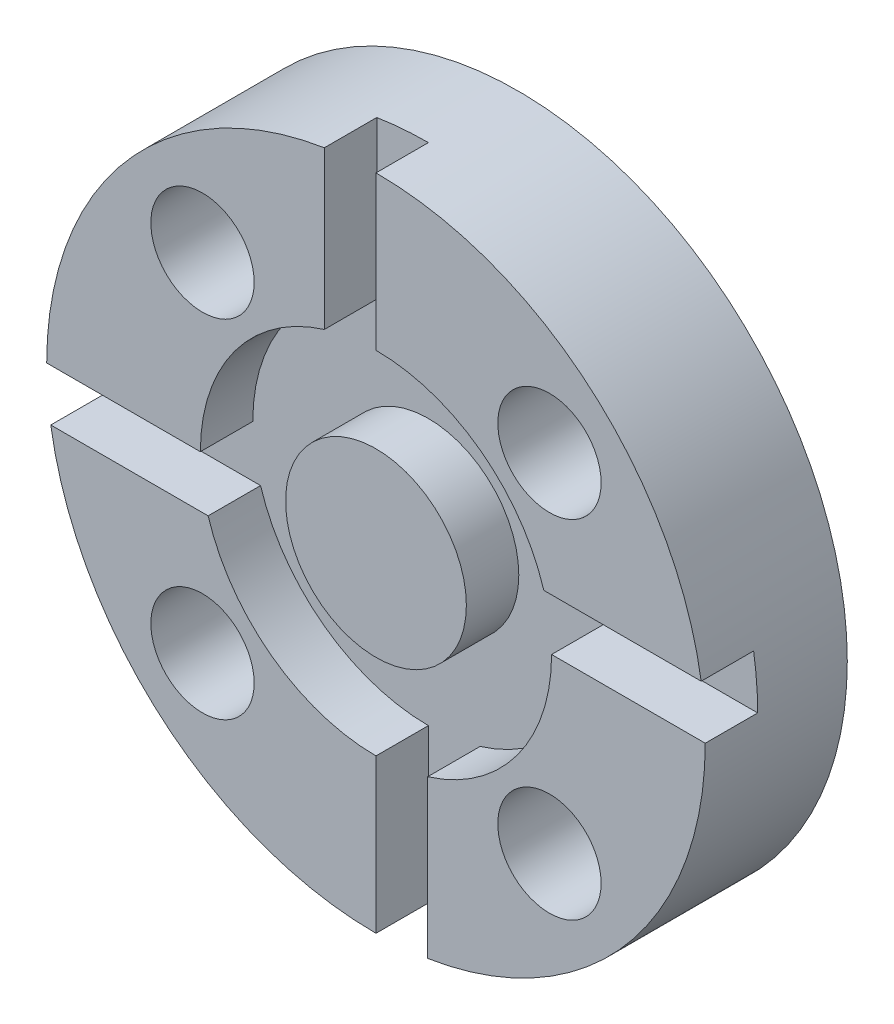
ISO-10303-21;
HEADER;
FILE_DESCRIPTION(('STEP AP214'),'2;1');
FILE_NAME('part.step','',(''),(''),'','','');
FILE_SCHEMA(('AUTOMOTIVE_DESIGN { 1 0 10303 214 1 1 1 1 }'));
ENDSEC;
DATA;
#1=APPLICATION_CONTEXT('core data for automotive mechanical design processes');
#2=APPLICATION_PROTOCOL_DEFINITION('international standard','automotive_design',2000,#1);
#3=PRODUCT_CONTEXT('',#1,'mechanical');
#4=PRODUCT('Part','Part','',(#3));
#5=PRODUCT_RELATED_PRODUCT_CATEGORY('part','',(#4));
#6=PRODUCT_DEFINITION_FORMATION('','',#4);
#7=PRODUCT_DEFINITION_CONTEXT('part definition',#1,'design');
#8=PRODUCT_DEFINITION('design','',#6,#7);
#9=PRODUCT_DEFINITION_SHAPE('','',#8);
#10=(LENGTH_UNIT() NAMED_UNIT(*) SI_UNIT(.MILLI.,.METRE.));
#11=(NAMED_UNIT(*) PLANE_ANGLE_UNIT() SI_UNIT($,.RADIAN.));
#12=(NAMED_UNIT(*) SI_UNIT($,.STERADIAN.) SOLID_ANGLE_UNIT());
#13=UNCERTAINTY_MEASURE_WITH_UNIT(LENGTH_MEASURE(1.E-05),#10,'distance_accuracy_value','');
#14=(GEOMETRIC_REPRESENTATION_CONTEXT(3) GLOBAL_UNCERTAINTY_ASSIGNED_CONTEXT((#13)) GLOBAL_UNIT_ASSIGNED_CONTEXT((#10,
#11,#12)) REPRESENTATION_CONTEXT('',''));
#15=CARTESIAN_POINT('',(0.,0.,0.));
#16=DIRECTION('',(0.,0.,1.));
#17=DIRECTION('',(1.,0.,0.));
#18=AXIS2_PLACEMENT_3D('',#15,#16,#17);
#19=CARTESIAN_POINT('',(0.,0.,55.));
#20=DIRECTION('',(0.,0.,1.));
#21=DIRECTION('',(1.,0.,0.));
#22=AXIS2_PLACEMENT_3D('',#19,#20,#21);
#23=PLANE('',#22);
#24=DIRECTION('',(0.,-1.,0.));
#25=VECTOR('',#24,1.);
#26=CARTESIAN_POINT('',(-20.,28.7228132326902,55.));
#27=LINE('',#26,#25);
#28=CARTESIAN_POINT('',(-20.,125.92160259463,55.));
#29=VERTEX_POINT('',#28);
#30=CARTESIAN_POINT('',(-20.,64.9923072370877,55.));
#31=VERTEX_POINT('',#30);
#32=EDGE_CURVE('E159',#29,#31,#27,.T.);
#33=ORIENTED_EDGE('',*,*,#32,.F.);
#34=CARTESIAN_POINT('',(0.,0.,55.));
#35=DIRECTION('',(0.,0.,1.));
#36=DIRECTION('',(1.,0.,0.));
#37=AXIS2_PLACEMENT_3D('',#34,#35,#36);
#38=CIRCLE('',#37,127.5);
#39=CARTESIAN_POINT('',(-127.5,0.,55.));
#40=VERTEX_POINT('',#39);
#41=EDGE_CURVE('E52',#29,#40,#38,.T.);
#42=ORIENTED_EDGE('',*,*,#41,.T.);
#43=DIRECTION('',(-1.,0.,0.));
#44=VECTOR('',#43,1.);
#45=CARTESIAN_POINT('',(-35.,0.,55.));
#46=LINE('',#45,#44);
#47=CARTESIAN_POINT('',(-68.,0.,55.));
#48=VERTEX_POINT('',#47);
#49=EDGE_CURVE('E242',#48,#40,#46,.T.);
#50=ORIENTED_EDGE('',*,*,#49,.F.);
#51=CARTESIAN_POINT('',(0.,0.,55.));
#52=DIRECTION('',(0.,0.,1.));
#53=DIRECTION('',(1.,0.,0.));
#54=AXIS2_PLACEMENT_3D('',#51,#52,#53);
#55=CIRCLE('',#54,68.);
#56=EDGE_CURVE('E173',#31,#48,#55,.T.);
#57=ORIENTED_EDGE('',*,*,#56,.F.);
#58=EDGE_LOOP('',(#33,#42,#50,#57));
#59=FACE_BOUND('',#58,.T.);
#60=CARTESIAN_POINT('',(-67.1751442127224,67.1751442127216,55.));
#61=DIRECTION('',(0.,0.,1.));
#62=DIRECTION('',(1.,0.,0.));
#63=AXIS2_PLACEMENT_3D('',#60,#61,#62);
#64=CIRCLE('',#63,20.);
#65=CARTESIAN_POINT('',(-47.1751442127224,67.1751442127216,55.));
#66=VERTEX_POINT('',#65);
#67=EDGE_CURVE('E184',#66,#66,#64,.T.);
#68=ORIENTED_EDGE('',*,*,#67,.F.);
#69=EDGE_LOOP('',(#68));
#70=FACE_BOUND('',#69,.T.);
#71=ADVANCED_FACE('F43',(#59,#70),#23,.T.);
#72=CARTESIAN_POINT('',(0.,0.,34.7));
#73=DIRECTION('',(0.,0.,1.));
#74=DIRECTION('',(1.,0.,0.));
#75=AXIS2_PLACEMENT_3D('',#72,#73,#74);
#76=CYLINDRICAL_SURFACE('',#75,68.);
#77=CARTESIAN_POINT('',(0.,0.,34.7));
#78=DIRECTION('',(0.,0.,1.));
#79=DIRECTION('',(1.,0.,0.));
#80=AXIS2_PLACEMENT_3D('',#77,#78,#79);
#81=CIRCLE('',#80,68.);
#82=CARTESIAN_POINT('',(-20.,64.9923072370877,34.7));
#83=VERTEX_POINT('',#82);
#84=CARTESIAN_POINT('',(-68.,0.,34.7));
#85=VERTEX_POINT('',#84);
#86=EDGE_CURVE('E214',#83,#85,#81,.T.);
#87=ORIENTED_EDGE('',*,*,#86,.F.);
#88=DIRECTION('',(0.,0.,1.));
#89=VECTOR('',#88,1.);
#90=CARTESIAN_POINT('',(-20.,64.9923072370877,34.7));
#91=LINE('',#90,#89);
#92=EDGE_CURVE('E166',#83,#31,#91,.T.);
#93=ORIENTED_EDGE('',*,*,#92,.T.);
#94=ORIENTED_EDGE('',*,*,#56,.T.);
#95=DIRECTION('',(0.,0.,1.));
#96=VECTOR('',#95,1.);
#97=CARTESIAN_POINT('',(-68.,0.,34.7));
#98=LINE('',#97,#96);
#99=EDGE_CURVE('E226',#48,#85,#98,.F.);
#100=ORIENTED_EDGE('',*,*,#99,.T.);
#101=EDGE_LOOP('',(#87,#93,#94,#100));
#102=FACE_BOUND('',#101,.T.);
#103=ADVANCED_FACE('F327',(#102),#76,.F.);
#104=DIRECTION('',(1.,0.,0.));
#105=VECTOR('',#104,1.);
#106=CARTESIAN_POINT('',(35.,0.,55.));
#107=LINE('',#106,#105);
#108=CARTESIAN_POINT('',(68.,0.,55.));
#109=VERTEX_POINT('',#108);
#110=CARTESIAN_POINT('',(127.5,0.,55.));
#111=VERTEX_POINT('',#110);
#112=EDGE_CURVE('E287',#109,#111,#107,.T.);
#113=ORIENTED_EDGE('',*,*,#112,.F.);
#114=CARTESIAN_POINT('',(20.,-64.9923072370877,55.));
#115=VERTEX_POINT('',#114);
#116=EDGE_CURVE('E218',#115,#109,#55,.T.);
#117=ORIENTED_EDGE('',*,*,#116,.F.);
#118=DIRECTION('',(0.,1.,0.));
#119=VECTOR('',#118,1.);
#120=CARTESIAN_POINT('',(20.,-28.7228132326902,55.));
#121=LINE('',#120,#119);
#122=CARTESIAN_POINT('',(20.,-125.92160259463,55.));
#123=VERTEX_POINT('',#122);
#124=EDGE_CURVE('E267',#123,#115,#121,.T.);
#125=ORIENTED_EDGE('',*,*,#124,.F.);
#126=EDGE_CURVE('E51',#123,#111,#38,.T.);
#127=ORIENTED_EDGE('',*,*,#126,.T.);
#128=EDGE_LOOP('',(#113,#117,#125,#127));
#129=FACE_BOUND('',#128,.T.);
#130=CARTESIAN_POINT('',(67.1751442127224,-67.1751442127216,55.));
#131=DIRECTION('',(0.,0.,1.));
#132=DIRECTION('',(1.,0.,0.));
#133=AXIS2_PLACEMENT_3D('',#130,#131,#132);
#134=CIRCLE('',#133,20.000000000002);
#135=CARTESIAN_POINT('',(87.1751442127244,-67.1751442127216,55.));
#136=VERTEX_POINT('',#135);
#137=EDGE_CURVE('E198',#136,#136,#134,.T.);
#138=ORIENTED_EDGE('',*,*,#137,.F.);
#139=EDGE_LOOP('',(#138));
#140=FACE_BOUND('',#139,.T.);
#141=ADVANCED_FACE('F337',(#129,#140),#23,.T.);
#142=ORIENTED_EDGE('',*,*,#116,.T.);
#143=DIRECTION('',(0.,0.,1.));
#144=VECTOR('',#143,1.);
#145=CARTESIAN_POINT('',(68.,0.,34.7));
#146=LINE('',#145,#144);
#147=CARTESIAN_POINT('',(68.,0.,34.7));
#148=VERTEX_POINT('',#147);
#149=EDGE_CURVE('E269',#109,#148,#146,.F.);
#150=ORIENTED_EDGE('',*,*,#149,.T.);
#151=CARTESIAN_POINT('',(20.,-64.9923072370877,34.7));
#152=VERTEX_POINT('',#151);
#153=EDGE_CURVE('E213',#152,#148,#81,.T.);
#154=ORIENTED_EDGE('',*,*,#153,.F.);
#155=DIRECTION('',(0.,0.,1.));
#156=VECTOR('',#155,1.);
#157=CARTESIAN_POINT('',(20.,-64.9923072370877,34.7));
#158=LINE('',#157,#156);
#159=EDGE_CURVE('E257',#152,#115,#158,.T.);
#160=ORIENTED_EDGE('',*,*,#159,.T.);
#161=EDGE_LOOP('',(#142,#150,#154,#160));
#162=FACE_BOUND('',#161,.T.);
#163=ADVANCED_FACE('F331',(#162),#76,.F.);
#164=DIRECTION('',(0.,1.,0.));
#165=VECTOR('',#164,1.);
#166=CARTESIAN_POINT('',(0.,35.,55.));
#167=LINE('',#166,#165);
#168=CARTESIAN_POINT('',(0.,68.,55.));
#169=VERTEX_POINT('',#168);
#170=CARTESIAN_POINT('',(0.,127.5,55.));
#171=VERTEX_POINT('',#170);
#172=EDGE_CURVE('E174',#169,#171,#167,.T.);
#173=ORIENTED_EDGE('',*,*,#172,.F.);
#174=CARTESIAN_POINT('',(64.9923072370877,20.,55.));
#175=VERTEX_POINT('',#174);
#176=EDGE_CURVE('E312',#175,#169,#55,.T.);
#177=ORIENTED_EDGE('',*,*,#176,.F.);
#178=DIRECTION('',(-1.,0.,0.));
#179=VECTOR('',#178,1.);
#180=CARTESIAN_POINT('',(28.7228132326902,20.,55.));
#181=LINE('',#180,#179);
#182=CARTESIAN_POINT('',(125.92160259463,20.,55.));
#183=VERTEX_POINT('',#182);
#184=EDGE_CURVE('E289',#183,#175,#181,.T.);
#185=ORIENTED_EDGE('',*,*,#184,.F.);
#186=EDGE_CURVE('E180',#183,#171,#38,.T.);
#187=ORIENTED_EDGE('',*,*,#186,.T.);
#188=EDGE_LOOP('',(#173,#177,#185,#187));
#189=FACE_BOUND('',#188,.T.);
#190=CARTESIAN_POINT('',(67.1751442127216,67.1751442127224,55.));
#191=DIRECTION('',(0.,0.,1.));
#192=DIRECTION('',(1.,0.,0.));
#193=AXIS2_PLACEMENT_3D('',#190,#191,#192);
#194=CIRCLE('',#193,20.0000000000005);
#195=CARTESIAN_POINT('',(87.1751442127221,67.1751442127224,55.));
#196=VERTEX_POINT('',#195);
#197=EDGE_CURVE('E192',#196,#196,#194,.T.);
#198=ORIENTED_EDGE('',*,*,#197,.F.);
#199=EDGE_LOOP('',(#198));
#200=FACE_BOUND('',#199,.T.);
#201=ADVANCED_FACE('F310',(#189,#200),#23,.T.);
#202=ORIENTED_EDGE('',*,*,#176,.T.);
#203=DIRECTION('',(0.,0.,1.));
#204=VECTOR('',#203,1.);
#205=CARTESIAN_POINT('',(0.,68.,34.7));
#206=LINE('',#205,#204);
#207=CARTESIAN_POINT('',(0.,68.,34.7));
#208=VERTEX_POINT('',#207);
#209=EDGE_CURVE('E291',#169,#208,#206,.F.);
#210=ORIENTED_EDGE('',*,*,#209,.T.);
#211=CARTESIAN_POINT('',(64.9923072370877,20.,34.7));
#212=VERTEX_POINT('',#211);
#213=EDGE_CURVE('E319',#212,#208,#81,.T.);
#214=ORIENTED_EDGE('',*,*,#213,.F.);
#215=DIRECTION('',(0.,0.,1.));
#216=VECTOR('',#215,1.);
#217=CARTESIAN_POINT('',(64.9923072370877,20.,34.7));
#218=LINE('',#217,#216);
#219=EDGE_CURVE('E277',#212,#175,#218,.T.);
#220=ORIENTED_EDGE('',*,*,#219,.T.);
#221=EDGE_LOOP('',(#202,#210,#214,#220));
#222=FACE_BOUND('',#221,.T.);
#223=ADVANCED_FACE('F318',(#222),#76,.F.);
#224=DIRECTION('',(0.,-1.,0.));
#225=VECTOR('',#224,1.);
#226=CARTESIAN_POINT('',(0.,-35.,55.));
#227=LINE('',#226,#225);
#228=CARTESIAN_POINT('',(0.,-68.,55.));
#229=VERTEX_POINT('',#228);
#230=CARTESIAN_POINT('',(0.,-127.5,55.));
#231=VERTEX_POINT('',#230);
#232=EDGE_CURVE('E265',#229,#231,#227,.T.);
#233=ORIENTED_EDGE('',*,*,#232,.F.);
#234=CARTESIAN_POINT('',(-64.9923072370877,-20.,55.));
#235=VERTEX_POINT('',#234);
#236=EDGE_CURVE('E215',#235,#229,#55,.T.);
#237=ORIENTED_EDGE('',*,*,#236,.F.);
#238=DIRECTION('',(1.,0.,0.));
#239=VECTOR('',#238,1.);
#240=CARTESIAN_POINT('',(-140.,-20.,55.));
#241=LINE('',#240,#239);
#242=CARTESIAN_POINT('',(-125.92160259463,-20.,55.));
#243=VERTEX_POINT('',#242);
#244=EDGE_CURVE('E244',#243,#235,#241,.T.);
#245=ORIENTED_EDGE('',*,*,#244,.F.);
#246=EDGE_CURVE('E13',#243,#231,#38,.T.);
#247=ORIENTED_EDGE('',*,*,#246,.T.);
#248=EDGE_LOOP('',(#233,#237,#245,#247));
#249=FACE_BOUND('',#248,.T.);
#250=CARTESIAN_POINT('',(-67.17514421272,-67.1751442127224,55.));
#251=DIRECTION('',(0.,0.,1.));
#252=DIRECTION('',(1.,0.,0.));
#253=AXIS2_PLACEMENT_3D('',#250,#251,#252);
#254=CIRCLE('',#253,20.);
#255=CARTESIAN_POINT('',(-47.17514421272,-67.1751442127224,55.));
#256=VERTEX_POINT('',#255);
#257=EDGE_CURVE('E204',#256,#256,#254,.T.);
#258=ORIENTED_EDGE('',*,*,#257,.F.);
#259=EDGE_LOOP('',(#258));
#260=FACE_BOUND('',#259,.T.);
#261=ADVANCED_FACE('F358',(#249,#260),#23,.T.);
#262=CARTESIAN_POINT('',(0.,0.,0.));
#263=DIRECTION('',(0.,0.,1.));
#264=DIRECTION('',(1.,0.,0.));
#265=AXIS2_PLACEMENT_3D('',#262,#263,#264);
#266=PLANE('',#265);
#267=CARTESIAN_POINT('',(67.1751442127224,-67.1751442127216,0.));
#268=DIRECTION('',(0.,0.,1.));
#269=DIRECTION('',(1.,0.,0.));
#270=AXIS2_PLACEMENT_3D('',#267,#268,#269);
#271=CIRCLE('',#270,20.000000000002);
#272=CARTESIAN_POINT('',(87.1751442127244,-67.1751442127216,0.));
#273=VERTEX_POINT('',#272);
#274=EDGE_CURVE('E201',#273,#273,#271,.T.);
#275=ORIENTED_EDGE('',*,*,#274,.T.);
#276=EDGE_LOOP('',(#275));
#277=FACE_BOUND('',#276,.T.);
#278=CARTESIAN_POINT('',(-67.1751442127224,67.1751442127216,0.));
#279=DIRECTION('',(0.,0.,1.));
#280=DIRECTION('',(1.,0.,0.));
#281=AXIS2_PLACEMENT_3D('',#278,#279,#280);
#282=CIRCLE('',#281,20.);
#283=CARTESIAN_POINT('',(-47.1751442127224,67.1751442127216,0.));
#284=VERTEX_POINT('',#283);
#285=EDGE_CURVE('E187',#284,#284,#282,.T.);
#286=ORIENTED_EDGE('',*,*,#285,.T.);
#287=EDGE_LOOP('',(#286));
#288=FACE_BOUND('',#287,.T.);
#289=CARTESIAN_POINT('',(0.,0.,0.));
#290=DIRECTION('',(0.,0.,1.));
#291=DIRECTION('',(1.,0.,0.));
#292=AXIS2_PLACEMENT_3D('',#289,#290,#291);
#293=CIRCLE('',#292,127.5);
#294=CARTESIAN_POINT('',(127.5,0.,0.));
#295=VERTEX_POINT('',#294);
#296=EDGE_CURVE('E181',#295,#295,#293,.T.);
#297=ORIENTED_EDGE('',*,*,#296,.F.);
#298=EDGE_LOOP('',(#297));
#299=FACE_BOUND('',#298,.T.);
#300=CARTESIAN_POINT('',(67.1751442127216,67.1751442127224,0.));
#301=DIRECTION('',(0.,0.,1.));
#302=DIRECTION('',(1.,0.,0.));
#303=AXIS2_PLACEMENT_3D('',#300,#301,#302);
#304=CIRCLE('',#303,20.0000000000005);
#305=CARTESIAN_POINT('',(87.1751442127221,67.1751442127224,0.));
#306=VERTEX_POINT('',#305);
#307=EDGE_CURVE('E195',#306,#306,#304,.T.);
#308=ORIENTED_EDGE('',*,*,#307,.T.);
#309=EDGE_LOOP('',(#308));
#310=FACE_BOUND('',#309,.T.);
#311=CARTESIAN_POINT('',(-67.17514421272,-67.1751442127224,0.));
#312=DIRECTION('',(0.,0.,1.));
#313=DIRECTION('',(1.,0.,0.));
#314=AXIS2_PLACEMENT_3D('',#311,#312,#313);
#315=CIRCLE('',#314,20.);
#316=CARTESIAN_POINT('',(-47.17514421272,-67.1751442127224,0.));
#317=VERTEX_POINT('',#316);
#318=EDGE_CURVE('E207',#317,#317,#315,.T.);
#319=ORIENTED_EDGE('',*,*,#318,.T.);
#320=EDGE_LOOP('',(#319));
#321=FACE_BOUND('',#320,.T.);
#322=ADVANCED_FACE('F382',(#277,#288,#299,#310,#321),#266,.F.);
#323=CARTESIAN_POINT('',(0.,0.,55.));
#324=DIRECTION('',(0.,0.,-1.));
#325=DIRECTION('',(-1.,0.,0.));
#326=AXIS2_PLACEMENT_3D('',#323,#324,#325);
#327=CYLINDRICAL_SURFACE('',#326,127.5);
#328=ORIENTED_EDGE('',*,*,#41,.F.);
#329=DIRECTION('',(0.,0.,-1.));
#330=VECTOR('',#329,1.);
#331=CARTESIAN_POINT('',(-20.,125.92160259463,55.));
#332=LINE('',#331,#330);
#333=CARTESIAN_POINT('',(-20.,125.92160259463,34.7));
#334=VERTEX_POINT('',#333);
#335=EDGE_CURVE('E156',#29,#334,#332,.T.);
#336=ORIENTED_EDGE('',*,*,#335,.T.);
#337=CARTESIAN_POINT('',(0.,0.,34.7));
#338=DIRECTION('',(0.,0.,1.));
#339=DIRECTION('',(1.,0.,0.));
#340=AXIS2_PLACEMENT_3D('',#337,#338,#339);
#341=CIRCLE('',#340,127.5);
#342=CARTESIAN_POINT('',(0.,127.5,34.7));
#343=VERTEX_POINT('',#342);
#344=EDGE_CURVE('E297',#343,#334,#341,.T.);
#345=ORIENTED_EDGE('',*,*,#344,.F.);
#346=DIRECTION('',(0.,0.,-1.));
#347=VECTOR('',#346,1.);
#348=CARTESIAN_POINT('',(0.,127.5,55.));
#349=LINE('',#348,#347);
#350=EDGE_CURVE('E294',#343,#171,#349,.F.);
#351=ORIENTED_EDGE('',*,*,#350,.T.);
#352=ORIENTED_EDGE('',*,*,#186,.F.);
#353=DIRECTION('',(0.,0.,-1.));
#354=VECTOR('',#353,1.);
#355=CARTESIAN_POINT('',(125.92160259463,20.,55.));
#356=LINE('',#355,#354);
#357=CARTESIAN_POINT('',(125.92160259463,20.,34.7));
#358=VERTEX_POINT('',#357);
#359=EDGE_CURVE('E280',#183,#358,#356,.T.);
#360=ORIENTED_EDGE('',*,*,#359,.T.);
#361=CARTESIAN_POINT('',(0.,0.,34.7));
#362=DIRECTION('',(0.,0.,1.));
#363=DIRECTION('',(1.,0.,0.));
#364=AXIS2_PLACEMENT_3D('',#361,#362,#363);
#365=CIRCLE('',#364,127.5);
#366=CARTESIAN_POINT('',(127.5,0.,34.7));
#367=VERTEX_POINT('',#366);
#368=EDGE_CURVE('E275',#367,#358,#365,.T.);
#369=ORIENTED_EDGE('',*,*,#368,.F.);
#370=DIRECTION('',(0.,0.,-1.));
#371=VECTOR('',#370,1.);
#372=CARTESIAN_POINT('',(127.5,0.,55.));
#373=LINE('',#372,#371);
#374=EDGE_CURVE('E272',#367,#111,#373,.F.);
#375=ORIENTED_EDGE('',*,*,#374,.T.);
#376=ORIENTED_EDGE('',*,*,#126,.F.);
#377=DIRECTION('',(0.,0.,-1.));
#378=VECTOR('',#377,1.);
#379=CARTESIAN_POINT('',(20.,-125.92160259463,55.));
#380=LINE('',#379,#378);
#381=CARTESIAN_POINT('',(20.,-125.92160259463,34.7));
#382=VERTEX_POINT('',#381);
#383=EDGE_CURVE('E254',#123,#382,#380,.T.);
#384=ORIENTED_EDGE('',*,*,#383,.T.);
#385=CARTESIAN_POINT('',(0.,0.,34.7));
#386=DIRECTION('',(0.,0.,1.));
#387=DIRECTION('',(1.,0.,0.));
#388=AXIS2_PLACEMENT_3D('',#385,#386,#387);
#389=CIRCLE('',#388,127.5);
#390=CARTESIAN_POINT('',(0.,-127.5,34.7));
#391=VERTEX_POINT('',#390);
#392=EDGE_CURVE('E252',#391,#382,#389,.T.);
#393=ORIENTED_EDGE('',*,*,#392,.F.);
#394=DIRECTION('',(0.,0.,-1.));
#395=VECTOR('',#394,1.);
#396=CARTESIAN_POINT('',(0.,-127.5,55.));
#397=LINE('',#396,#395);
#398=EDGE_CURVE('E246',#391,#231,#397,.F.);
#399=ORIENTED_EDGE('',*,*,#398,.T.);
#400=ORIENTED_EDGE('',*,*,#246,.F.);
#401=DIRECTION('',(0.,0.,-1.));
#402=VECTOR('',#401,1.);
#403=CARTESIAN_POINT('',(-125.92160259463,-20.,55.));
#404=LINE('',#403,#402);
#405=CARTESIAN_POINT('',(-125.92160259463,-20.,34.7));
#406=VERTEX_POINT('',#405);
#407=EDGE_CURVE('E231',#243,#406,#404,.T.);
#408=ORIENTED_EDGE('',*,*,#407,.T.);
#409=CARTESIAN_POINT('',(0.,0.,34.7));
#410=DIRECTION('',(0.,0.,1.));
#411=DIRECTION('',(1.,0.,0.));
#412=AXIS2_PLACEMENT_3D('',#409,#410,#411);
#413=CIRCLE('',#412,127.5);
#414=CARTESIAN_POINT('',(-127.5,0.,34.7));
#415=VERTEX_POINT('',#414);
#416=EDGE_CURVE('E229',#415,#406,#413,.T.);
#417=ORIENTED_EDGE('',*,*,#416,.F.);
#418=DIRECTION('',(0.,0.,-1.));
#419=VECTOR('',#418,1.);
#420=CARTESIAN_POINT('',(-127.5,0.,55.));
#421=LINE('',#420,#419);
#422=EDGE_CURVE('E179',#415,#40,#421,.F.);
#423=ORIENTED_EDGE('',*,*,#422,.T.);
#424=EDGE_LOOP('',(#328,#336,#345,#351,#352,#360,#369,#375,#376,#384,#393,#399,#400,#408,#417,#423));
#425=FACE_BOUND('',#424,.T.);
#426=ORIENTED_EDGE('',*,*,#296,.T.);
#427=EDGE_LOOP('',(#426));
#428=FACE_BOUND('',#427,.T.);
#429=ADVANCED_FACE('F45',(#425,#428),#327,.T.);
#430=CARTESIAN_POINT('',(-67.1751442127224,67.1751442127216,55.));
#431=DIRECTION('',(0.,0.,-1.));
#432=DIRECTION('',(-1.,0.,0.));
#433=AXIS2_PLACEMENT_3D('',#430,#431,#432);
#434=CYLINDRICAL_SURFACE('',#433,20.);
#435=ORIENTED_EDGE('',*,*,#67,.T.);
#436=EDGE_LOOP('',(#435));
#437=FACE_BOUND('',#436,.T.);
#438=ORIENTED_EDGE('',*,*,#285,.F.);
#439=EDGE_LOOP('',(#438));
#440=FACE_BOUND('',#439,.T.);
#441=ADVANCED_FACE('F415',(#437,#440),#434,.F.);
#442=CARTESIAN_POINT('',(67.1751442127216,67.1751442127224,55.));
#443=DIRECTION('',(0.,0.,-1.));
#444=DIRECTION('',(-1.,0.,0.));
#445=AXIS2_PLACEMENT_3D('',#442,#443,#444);
#446=CYLINDRICAL_SURFACE('',#445,20.0000000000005);
#447=ORIENTED_EDGE('',*,*,#197,.T.);
#448=EDGE_LOOP('',(#447));
#449=FACE_BOUND('',#448,.T.);
#450=ORIENTED_EDGE('',*,*,#307,.F.);
#451=EDGE_LOOP('',(#450));
#452=FACE_BOUND('',#451,.T.);
#453=ADVANCED_FACE('F411',(#449,#452),#446,.F.);
#454=CARTESIAN_POINT('',(67.1751442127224,-67.1751442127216,55.));
#455=DIRECTION('',(0.,0.,-1.));
#456=DIRECTION('',(-1.,0.,0.));
#457=AXIS2_PLACEMENT_3D('',#454,#455,#456);
#458=CYLINDRICAL_SURFACE('',#457,20.000000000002);
#459=ORIENTED_EDGE('',*,*,#137,.T.);
#460=EDGE_LOOP('',(#459));
#461=FACE_BOUND('',#460,.T.);
#462=ORIENTED_EDGE('',*,*,#274,.F.);
#463=EDGE_LOOP('',(#462));
#464=FACE_BOUND('',#463,.T.);
#465=ADVANCED_FACE('F407',(#461,#464),#458,.F.);
#466=CARTESIAN_POINT('',(-67.17514421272,-67.1751442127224,55.));
#467=DIRECTION('',(0.,0.,-1.));
#468=DIRECTION('',(-1.,0.,0.));
#469=AXIS2_PLACEMENT_3D('',#466,#467,#468);
#470=CYLINDRICAL_SURFACE('',#469,20.);
#471=ORIENTED_EDGE('',*,*,#257,.T.);
#472=EDGE_LOOP('',(#471));
#473=FACE_BOUND('',#472,.T.);
#474=ORIENTED_EDGE('',*,*,#318,.F.);
#475=EDGE_LOOP('',(#474));
#476=FACE_BOUND('',#475,.T.);
#477=ADVANCED_FACE('F404',(#473,#476),#470,.F.);
#478=ORIENTED_EDGE('',*,*,#236,.T.);
#479=DIRECTION('',(0.,0.,1.));
#480=VECTOR('',#479,1.);
#481=CARTESIAN_POINT('',(0.,-68.,34.7));
#482=LINE('',#481,#480);
#483=CARTESIAN_POINT('',(0.,-68.,34.7));
#484=VERTEX_POINT('',#483);
#485=EDGE_CURVE('E249',#229,#484,#482,.F.);
#486=ORIENTED_EDGE('',*,*,#485,.T.);
#487=CARTESIAN_POINT('',(-64.9923072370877,-20.,34.7));
#488=VERTEX_POINT('',#487);
#489=EDGE_CURVE('E210',#488,#484,#81,.T.);
#490=ORIENTED_EDGE('',*,*,#489,.F.);
#491=DIRECTION('',(0.,0.,1.));
#492=VECTOR('',#491,1.);
#493=CARTESIAN_POINT('',(-64.9923072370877,-20.,34.7));
#494=LINE('',#493,#492);
#495=EDGE_CURVE('E234',#488,#235,#494,.T.);
#496=ORIENTED_EDGE('',*,*,#495,.T.);
#497=EDGE_LOOP('',(#478,#486,#490,#496));
#498=FACE_BOUND('',#497,.T.);
#499=ADVANCED_FACE('F353',(#498),#76,.F.);
#500=CARTESIAN_POINT('',(0.,0.,34.7));
#501=DIRECTION('',(0.,0.,1.));
#502=DIRECTION('',(1.,0.,0.));
#503=AXIS2_PLACEMENT_3D('',#500,#501,#502);
#504=PLANE('',#503);
#505=CARTESIAN_POINT('',(0.,0.,34.7));
#506=DIRECTION('',(0.,0.,1.));
#507=DIRECTION('',(1.,0.,0.));
#508=AXIS2_PLACEMENT_3D('',#505,#506,#507);
#509=CIRCLE('',#508,35.);
#510=CARTESIAN_POINT('',(35.,0.,34.7));
#511=VERTEX_POINT('',#510);
#512=EDGE_CURVE('E219',#511,#511,#509,.T.);
#513=ORIENTED_EDGE('',*,*,#512,.F.);
#514=EDGE_LOOP('',(#513));
#515=FACE_BOUND('',#514,.T.);
#516=ORIENTED_EDGE('',*,*,#213,.T.);
#517=DIRECTION('',(0.,1.,0.));
#518=VECTOR('',#517,1.);
#519=CARTESIAN_POINT('',(0.,35.,34.7));
#520=LINE('',#519,#518);
#521=EDGE_CURVE('E59',#208,#343,#520,.T.);
#522=ORIENTED_EDGE('',*,*,#521,.T.);
#523=ORIENTED_EDGE('',*,*,#344,.T.);
#524=DIRECTION('',(0.,-1.,0.));
#525=VECTOR('',#524,1.);
#526=CARTESIAN_POINT('',(-20.,28.7228132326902,34.7));
#527=LINE('',#526,#525);
#528=EDGE_CURVE('E162',#334,#83,#527,.T.);
#529=ORIENTED_EDGE('',*,*,#528,.T.);
#530=ORIENTED_EDGE('',*,*,#86,.T.);
#531=DIRECTION('',(-1.,0.,0.));
#532=VECTOR('',#531,1.);
#533=CARTESIAN_POINT('',(-35.,0.,34.7));
#534=LINE('',#533,#532);
#535=EDGE_CURVE('E237',#85,#415,#534,.T.);
#536=ORIENTED_EDGE('',*,*,#535,.T.);
#537=ORIENTED_EDGE('',*,*,#416,.T.);
#538=DIRECTION('',(1.,0.,0.));
#539=VECTOR('',#538,1.);
#540=CARTESIAN_POINT('',(-140.,-20.,34.7));
#541=LINE('',#540,#539);
#542=EDGE_CURVE('E240',#406,#488,#541,.T.);
#543=ORIENTED_EDGE('',*,*,#542,.T.);
#544=ORIENTED_EDGE('',*,*,#489,.T.);
#545=DIRECTION('',(0.,-1.,0.));
#546=VECTOR('',#545,1.);
#547=CARTESIAN_POINT('',(0.,-35.,34.7));
#548=LINE('',#547,#546);
#549=EDGE_CURVE('E260',#484,#391,#548,.T.);
#550=ORIENTED_EDGE('',*,*,#549,.T.);
#551=ORIENTED_EDGE('',*,*,#392,.T.);
#552=DIRECTION('',(0.,1.,0.));
#553=VECTOR('',#552,1.);
#554=CARTESIAN_POINT('',(20.,-28.7228132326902,34.7));
#555=LINE('',#554,#553);
#556=EDGE_CURVE('E263',#382,#152,#555,.T.);
#557=ORIENTED_EDGE('',*,*,#556,.T.);
#558=ORIENTED_EDGE('',*,*,#153,.T.);
#559=DIRECTION('',(1.,0.,0.));
#560=VECTOR('',#559,1.);
#561=CARTESIAN_POINT('',(35.,0.,34.7));
#562=LINE('',#561,#560);
#563=EDGE_CURVE('E66',#148,#367,#562,.T.);
#564=ORIENTED_EDGE('',*,*,#563,.T.);
#565=ORIENTED_EDGE('',*,*,#368,.T.);
#566=DIRECTION('',(-1.,0.,0.));
#567=VECTOR('',#566,1.);
#568=CARTESIAN_POINT('',(28.7228132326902,20.,34.7));
#569=LINE('',#568,#567);
#570=EDGE_CURVE('E284',#358,#212,#569,.T.);
#571=ORIENTED_EDGE('',*,*,#570,.T.);
#572=EDGE_LOOP('',(#516,#522,#523,#529,#530,#536,#537,#543,#544,#550,#551,#557,#558,#564,#565,#571));
#573=FACE_BOUND('',#572,.T.);
#574=ADVANCED_FACE('F322',(#515,#573),#504,.T.);
#575=CARTESIAN_POINT('',(0.,0.,34.7));
#576=DIRECTION('',(0.,0.,1.));
#577=DIRECTION('',(1.,0.,0.));
#578=AXIS2_PLACEMENT_3D('',#575,#576,#577);
#579=CYLINDRICAL_SURFACE('',#578,35.);
#580=CARTESIAN_POINT('',(0.,0.,55.));
#581=DIRECTION('',(0.,0.,1.));
#582=DIRECTION('',(1.,0.,0.));
#583=AXIS2_PLACEMENT_3D('',#580,#581,#582);
#584=CIRCLE('',#583,35.);
#585=CARTESIAN_POINT('',(35.,0.,55.));
#586=VERTEX_POINT('',#585);
#587=EDGE_CURVE('E222',#586,#586,#584,.T.);
#588=ORIENTED_EDGE('',*,*,#587,.F.);
#589=EDGE_LOOP('',(#588));
#590=FACE_BOUND('',#589,.T.);
#591=ORIENTED_EDGE('',*,*,#512,.T.);
#592=EDGE_LOOP('',(#591));
#593=FACE_BOUND('',#592,.T.);
#594=ADVANCED_FACE('F389',(#590,#593),#579,.T.);
#595=ORIENTED_EDGE('',*,*,#587,.T.);
#596=EDGE_LOOP('',(#595));
#597=FACE_BOUND('',#596,.T.);
#598=ADVANCED_FACE('F371',(#597),#23,.T.);
#599=CARTESIAN_POINT('',(-35.,0.,34.7));
#600=DIRECTION('',(0.,1.,0.));
#601=DIRECTION('',(-1.,0.,0.));
#602=AXIS2_PLACEMENT_3D('',#599,#600,#601);
#603=PLANE('',#602);
#604=ORIENTED_EDGE('',*,*,#535,.F.);
#605=ORIENTED_EDGE('',*,*,#99,.F.);
#606=ORIENTED_EDGE('',*,*,#49,.T.);
#607=ORIENTED_EDGE('',*,*,#422,.F.);
#608=EDGE_LOOP('',(#604,#605,#606,#607));
#609=FACE_BOUND('',#608,.T.);
#610=ADVANCED_FACE('F326',(#609),#603,.F.);
#611=CARTESIAN_POINT('',(-140.,-20.,34.7));
#612=DIRECTION('',(0.,-1.,0.));
#613=DIRECTION('',(0.,0.,-1.));
#614=AXIS2_PLACEMENT_3D('',#611,#612,#613);
#615=PLANE('',#614);
#616=ORIENTED_EDGE('',*,*,#244,.T.);
#617=ORIENTED_EDGE('',*,*,#495,.F.);
#618=ORIENTED_EDGE('',*,*,#542,.F.);
#619=ORIENTED_EDGE('',*,*,#407,.F.);
#620=EDGE_LOOP('',(#616,#617,#618,#619));
#621=FACE_BOUND('',#620,.T.);
#622=ADVANCED_FACE('F363',(#621),#615,.F.);
#623=CARTESIAN_POINT('',(0.,-35.,34.7));
#624=DIRECTION('',(-1.,0.,0.));
#625=DIRECTION('',(0.,0.,1.));
#626=AXIS2_PLACEMENT_3D('',#623,#624,#625);
#627=PLANE('',#626);
#628=ORIENTED_EDGE('',*,*,#549,.F.);
#629=ORIENTED_EDGE('',*,*,#485,.F.);
#630=ORIENTED_EDGE('',*,*,#232,.T.);
#631=ORIENTED_EDGE('',*,*,#398,.F.);
#632=EDGE_LOOP('',(#628,#629,#630,#631));
#633=FACE_BOUND('',#632,.T.);
#634=ADVANCED_FACE('F350',(#633),#627,.F.);
#635=CARTESIAN_POINT('',(20.,-28.7228132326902,34.7));
#636=DIRECTION('',(1.,0.,0.));
#637=DIRECTION('',(0.,1.,0.));
#638=AXIS2_PLACEMENT_3D('',#635,#636,#637);
#639=PLANE('',#638);
#640=ORIENTED_EDGE('',*,*,#124,.T.);
#641=ORIENTED_EDGE('',*,*,#159,.F.);
#642=ORIENTED_EDGE('',*,*,#556,.F.);
#643=ORIENTED_EDGE('',*,*,#383,.F.);
#644=EDGE_LOOP('',(#640,#641,#642,#643));
#645=FACE_BOUND('',#644,.T.);
#646=ADVANCED_FACE('F347',(#645),#639,.F.);
#647=CARTESIAN_POINT('',(35.,0.,34.7));
#648=DIRECTION('',(0.,-1.,0.));
#649=DIRECTION('',(0.,0.,-1.));
#650=AXIS2_PLACEMENT_3D('',#647,#648,#649);
#651=PLANE('',#650);
#652=ORIENTED_EDGE('',*,*,#112,.T.);
#653=ORIENTED_EDGE('',*,*,#374,.F.);
#654=ORIENTED_EDGE('',*,*,#563,.F.);
#655=ORIENTED_EDGE('',*,*,#149,.F.);
#656=EDGE_LOOP('',(#652,#653,#654,#655));
#657=FACE_BOUND('',#656,.T.);
#658=ADVANCED_FACE('F342',(#657),#651,.F.);
#659=CARTESIAN_POINT('',(28.7228132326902,20.,34.7));
#660=DIRECTION('',(0.,1.,0.));
#661=DIRECTION('',(0.,0.,1.));
#662=AXIS2_PLACEMENT_3D('',#659,#660,#661);
#663=PLANE('',#662);
#664=ORIENTED_EDGE('',*,*,#570,.F.);
#665=ORIENTED_EDGE('',*,*,#359,.F.);
#666=ORIENTED_EDGE('',*,*,#184,.T.);
#667=ORIENTED_EDGE('',*,*,#219,.F.);
#668=EDGE_LOOP('',(#664,#665,#666,#667));
#669=FACE_BOUND('',#668,.T.);
#670=ADVANCED_FACE('F315',(#669),#663,.F.);
#671=CARTESIAN_POINT('',(0.,35.,34.7));
#672=DIRECTION('',(1.,0.,0.));
#673=DIRECTION('',(0.,0.,-1.));
#674=AXIS2_PLACEMENT_3D('',#671,#672,#673);
#675=PLANE('',#674);
#676=ORIENTED_EDGE('',*,*,#172,.T.);
#677=ORIENTED_EDGE('',*,*,#350,.F.);
#678=ORIENTED_EDGE('',*,*,#521,.F.);
#679=ORIENTED_EDGE('',*,*,#209,.F.);
#680=EDGE_LOOP('',(#676,#677,#678,#679));
#681=FACE_BOUND('',#680,.T.);
#682=ADVANCED_FACE('F304',(#681),#675,.F.);
#683=CARTESIAN_POINT('',(-20.,28.7228132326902,34.7));
#684=DIRECTION('',(-1.,0.,0.));
#685=DIRECTION('',(0.,0.,1.));
#686=AXIS2_PLACEMENT_3D('',#683,#684,#685);
#687=PLANE('',#686);
#688=ORIENTED_EDGE('',*,*,#528,.F.);
#689=ORIENTED_EDGE('',*,*,#335,.F.);
#690=ORIENTED_EDGE('',*,*,#32,.T.);
#691=ORIENTED_EDGE('',*,*,#92,.F.);
#692=EDGE_LOOP('',(#688,#689,#690,#691));
#693=FACE_BOUND('',#692,.T.);
#694=ADVANCED_FACE('F158',(#693),#687,.F.);
#695=CLOSED_SHELL('',(#71,#103,#141,#163,#201,#223,#261,#322,#429,#441,#453,#465,#477,#499,#574,
#594,#598,#610,#622,#634,#646,#658,#670,#682,#694));
#696=MANIFOLD_SOLID_BREP('B2',#695);
#697=ADVANCED_BREP_SHAPE_REPRESENTATION('',(#18,#696),#14);
#698=SHAPE_DEFINITION_REPRESENTATION(#9,#697);
ENDSEC;
END-ISO-10303-21;
